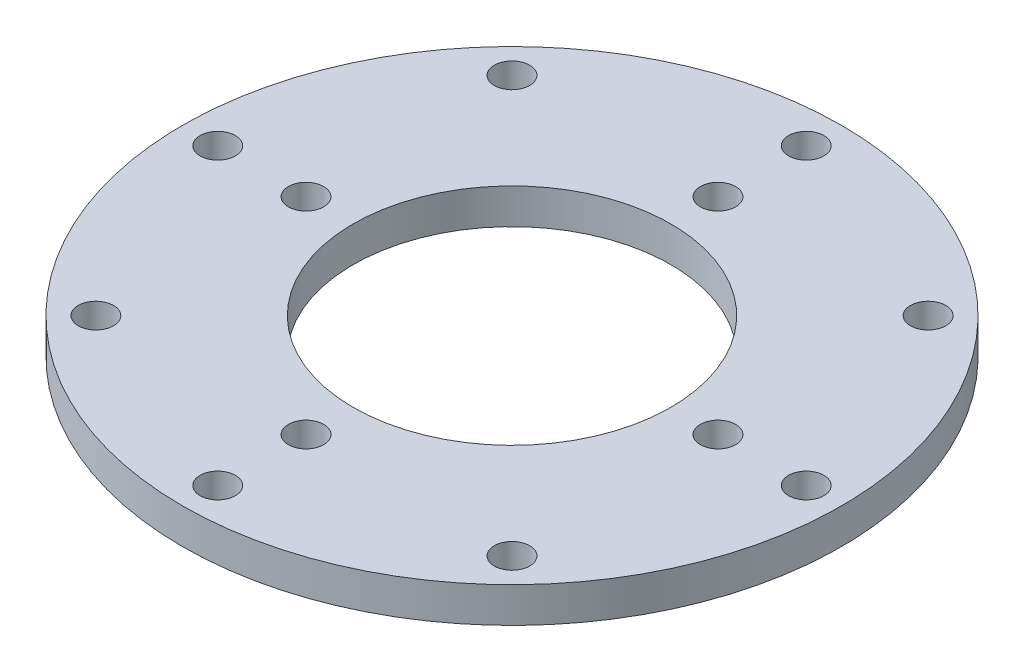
from build123d import *

# Parameters (mm, degrees)
SKETCH1_R           = 28
SKETCH1_R_2         = 13.5
SKETCH1_R_3         = 1.5
BOSS_EXTRUDE1_DEPTH = 3


with BuildPart() as part:
    # Sketch1 → Boss-Extrude1 (new body)
    with BuildSketch(Plane(origin=(0, 0, 0), x_dir=(1, 0, 0), z_dir=(0, 1, 0))):
        with Locations(Location((0, 0, 0), (0, 0, 270))):
            Circle(SKETCH1_R)
        with Locations(Location((0, 0, 0), (0, 0, 270))):
            Circle(SKETCH1_R_2, mode=Mode.SUBTRACT)
        with Locations(Location((0, -17.5, 0), (0, 0, 270))):
            Circle(SKETCH1_R_3, mode=Mode.SUBTRACT)
        with Locations(Location((-17.5, 0, 0), (0, 0, 270))):
            Circle(SKETCH1_R_3, mode=Mode.SUBTRACT)
        with Locations(Location((0, 17.5, 0), (0, 0, 270))):
            Circle(SKETCH1_R_3, mode=Mode.SUBTRACT)
        with Locations(Location((17.5, 0, 0), (0, 0, 270))):
            Circle(SKETCH1_R_3, mode=Mode.SUBTRACT)
        with Locations(Location((0, -25, 0), (0, 0, 270))):
            Circle(SKETCH1_R_3, mode=Mode.SUBTRACT)
        with Locations(Location((-17.67766953, -17.67766953, 0), (0, 0, 270))):
            Circle(SKETCH1_R_3, mode=Mode.SUBTRACT)
        with Locations(Location((-25, 0, 0), (0, 0, 270))):
            Circle(SKETCH1_R_3, mode=Mode.SUBTRACT)
        with Locations(Location((-17.67766953, 17.67766953, 0), (0, 0, 270))):
            Circle(SKETCH1_R_3, mode=Mode.SUBTRACT)
        with Locations(Location((0, 25, 0), (0, 0, 270))):
            Circle(SKETCH1_R_3, mode=Mode.SUBTRACT)
        with Locations(Location((17.67766953, 17.67766953, 0), (0, 0, 270))):
            Circle(SKETCH1_R_3, mode=Mode.SUBTRACT)
        with Locations(Location((25, 0, 0), (0, 0, 270))):
            Circle(SKETCH1_R_3, mode=Mode.SUBTRACT)
        with Locations(Location((17.67766953, -17.67766953, 0), (0, 0, 270))):
            Circle(SKETCH1_R_3, mode=Mode.SUBTRACT)
    extrude(amount=BOSS_EXTRUDE1_DEPTH)


solid = part.part
